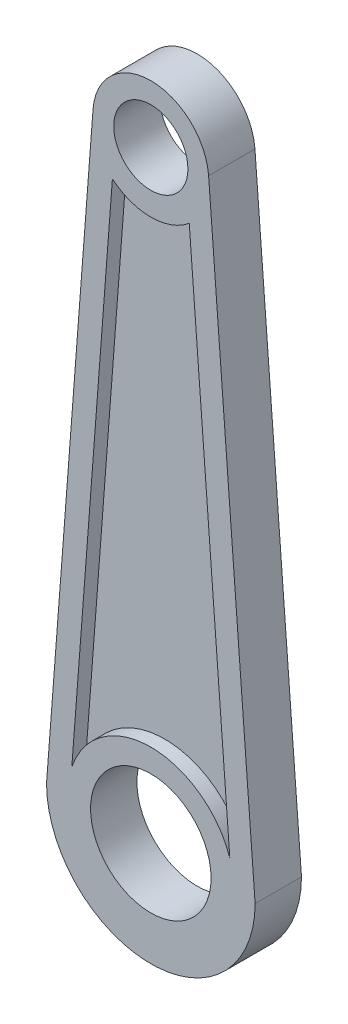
from build123d import *

# Parameters (mm, degrees)
SKETCH1_R           = 13
SKETCH1_R_2         = 12.5
SKETCH1_R_3         = 8
BOSS_EXTRUDE1_DEPTH = 10
CUT_EXTRUDE1_DEPTH  = 3


with BuildPart() as part:
    # Sketch1 → Boss-Extrude1 (new body)
    # profile 1 of 3: a face of its own
    with BuildSketch(Plane.XY):
        with BuildLine():
            Line((-12.463449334, 130.955212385), (-22.237219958, 3.428709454))
            ThreePointArc((-22.237219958, 3.428709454), (0, 22.5), (22.237219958, 3.428709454))
            Line((22.237219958, 3.428709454), (12.463449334, 130.955212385))
            ThreePointArc((12.463449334, 130.955212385), (12.490858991, 130.477955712), (12.5, 130))
            ThreePointArc((12.5, 130), (-0.477955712, 117.509141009), (-12.463449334, 130.955212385))
        make_face()
    # profile 2 of 3: a face of its own
    with BuildSketch(Plane.XY):
        with BuildLine():
            Line((-22.237219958, 3.428709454), (-22.5, 0))
            ThreePointArc((-22.5, 0), (0, -22.5), (22.5, 0))
            Line((22.5, 0), (22.237219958, 3.428709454))
            ThreePointArc((22.237219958, 3.428709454), (0, 22.5), (-22.237219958, 3.428709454))
        make_face()
        Circle(SKETCH1_R, mode=Mode.SUBTRACT)
    # profile 3 of 3: a face of its own
    with BuildSketch(Plane.XY):
        with Locations((0, 130)):
            Circle(SKETCH1_R_2)
        with Locations((0, 130)):
            Circle(SKETCH1_R_3, mode=Mode.SUBTRACT)
    extrude(amount=BOSS_EXTRUDE1_DEPTH)

    # Sketch2 → Cut-Extrude1 (cut)
    with BuildSketch(Plane.XY.offset(10)):
        with BuildLine():
            Line((17.041070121, 5.796717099), (8.289494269, 119.98579585))
            ThreePointArc((8.289494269, 119.98579585), (0, 117), (-8.289494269, 119.98579585))
            Line((-8.289494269, 119.98579585), (-17.041070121, 5.796717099))
            ThreePointArc((-17.041070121, 5.796717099), (0, 18), (17.041070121, 5.796717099))
        make_face()
    cut_extrude1 = extrude(amount=-CUT_EXTRUDE1_DEPTH, mode=Mode.SUBTRACT)

    # Mirror2: Cut-Extrude1 across plane
    add(cut_extrude1.mirror(Plane.XY.offset(5)), mode=Mode.SUBTRACT)


solid = part.part
